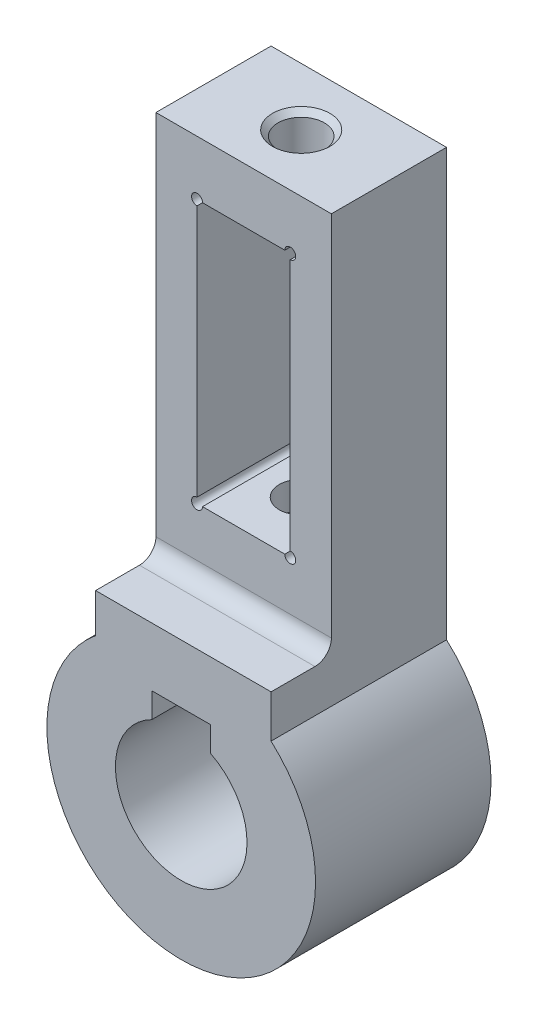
from build123d import *

# Parameters (mm, degrees)
SKETCH1_W                 = 32
SKETCH1_H                 = 70
BOSS_EXTRUDE1_DEPTH       = 21
BOSS_EXTRUDE2_DEPTH       = 32
FILLET1_R                 = 3
SKETCH4_R                 = 4.231264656
CUT_EXTRUDE1_DEPTH        = 32
CHAMFER1_SIZE             = 1
F_8_0MM_DOWEL_HOLE1_D     = 8
F_8_0MM_DOWEL_HOLE1_DEPTH = 5
F_8_0MM_DOWEL_HOLE1_TIP   = 2.403442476


with BuildPart() as part:
    # Sketch1 → Boss-Extrude1 (new body)
    with BuildSketch(Plane.XY):
        with Locations((0, -1)):
            Rectangle(SKETCH1_W, SKETCH1_H)
        with BuildLine():
            ThreePointArc((-8.5, 23), (-9.207106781, 24.707106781), (-7.5, 24))
            Line((-7.5, 24), (7.5, 24))
            ThreePointArc((7.5, 24), (8.5, 25), (9.5, 24))
            ThreePointArc((9.5, 24), (9.207106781, 23.292893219), (8.5, 23))
            Line((8.5, 23), (8.5, -23))
            ThreePointArc((8.5, -23), (9.207106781, -23.292893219), (9.5, -24))
            ThreePointArc((9.5, -24), (8.5, -25), (7.5, -24))
            Line((7.5, -24), (-7.5, -24))
            ThreePointArc((-7.5, -24), (-9.207106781, -24.707106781), (-8.5, -23))
            Line((-8.5, -23), (-8.5, 23))
        make_face(mode=Mode.SUBTRACT)
    extrude(amount=BOSS_EXTRUDE1_DEPTH)

    # Sketch3 → Boss-Extrude2 (add)
    with BuildSketch(Plane.XY):
        with BuildLine():
            Line((16, -36), (-16, -36))
            Line((-16, -36), (-16, -43.121704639))
            ThreePointArc((-16, -43.121704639), (0.123136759, -37.505248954), (16, -43.784208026))
            Line((16, -43.784208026), (16, -36))
        make_face()
        with BuildLine():
            Line((-16, -52.893810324), (-16, -43.121704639))
            ThreePointArc((-16, -43.121704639), (-10.816088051, -84.168021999), (24.116016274, -62))
            ThreePointArc((24.116016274, -62), (21.995220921, -52.02898203), (16, -43.784208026))
            Line((16, -43.784208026), (16, -52.893810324))
            Line((16, -52.893810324), (7.431213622, -52.893810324))
            ThreePointArc((7.431213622, -52.893810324), (10.519739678, -56.989130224), (11.616016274, -62))
            ThreePointArc((11.616016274, -62), (-5.394853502, -72.903723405), (-8.199181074, -52.893810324))
            Line((-8.199181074, -52.893810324), (-16, -52.893810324))
        make_face()
        with BuildLine():
            ThreePointArc((16, -43.784208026), (0.123136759, -37.505248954), (-16, -43.121704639))
            Line((-16, -43.121704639), (-16, -52.893810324))
            Line((-16, -52.893810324), (-8.199181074, -52.893810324))
            ThreePointArc((-8.199181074, -52.893810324), (-7.028062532, -52.007191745), (-5.757393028, -51.270299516))
            Line((-5.757393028, -51.270299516), (-5.757393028, -46.7))
            Line((-5.757393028, -46.7), (4.989425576, -46.7))
            Line((4.989425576, -46.7), (4.989425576, -51.270299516))
            ThreePointArc((4.989425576, -51.270299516), (6.260095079, -52.007191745), (7.431213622, -52.893810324))
            Line((7.431213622, -52.893810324), (16, -52.893810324))
            Line((16, -52.893810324), (16, -43.784208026))
        make_face()
    extrude(amount=BOSS_EXTRUDE2_DEPTH)

    # Fillet1
    fillet1_edges = [part.edges().sort_by_distance(p)[0] for p in [
        (0, -36, 21),
    ]]
    fillet(fillet1_edges, radius=FILLET1_R)

    # Sketch4 → Cut-Extrude1 (cut)
    with BuildSketch(Plane(origin=(0, 34, 0), x_dir=(1, 0, 0), z_dir=(0, 1, 0))):
        with Locations(Location((0, -10.5, 0), (0, 0, 270))):
            Circle(SKETCH4_R)
    extrude(amount=-CUT_EXTRUDE1_DEPTH, mode=Mode.SUBTRACT)

    # Chamfer1
    chamfer1_edges = [part.edges().sort_by_distance(p)[0] for p in [
        (0, 34, 6.268735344),
    ]]
    chamfer(chamfer1_edges, length=CHAMFER1_SIZE)

    # 8.0mm Dowel Hole1
    with Locations(Plane(origin=(0, -24, 10.5), x_dir=(0, 0, 1), z_dir=(0, 1, 0))):
        with Locations((0, 0)):
            Hole(F_8_0MM_DOWEL_HOLE1_D / 2, depth=F_8_0MM_DOWEL_HOLE1_DEPTH)
            with Locations((0, 0, -(F_8_0MM_DOWEL_HOLE1_DEPTH + F_8_0MM_DOWEL_HOLE1_TIP / 2))):  # 118° drill point
                Cone(0, F_8_0MM_DOWEL_HOLE1_D / 2, F_8_0MM_DOWEL_HOLE1_TIP, mode=Mode.SUBTRACT)


solid = part.part
